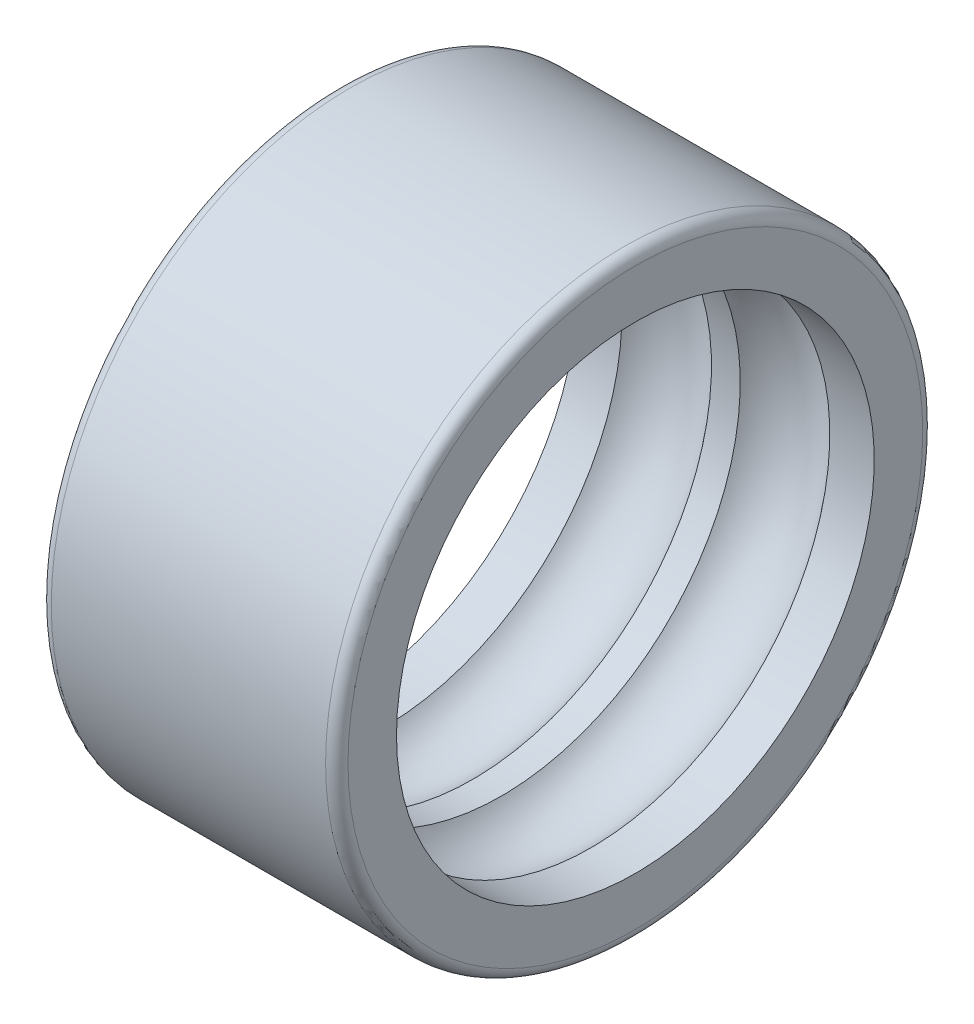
ISO-10303-21;
HEADER;
FILE_DESCRIPTION(('STEP AP214'),'2;1');
FILE_NAME('part.step','',(''),(''),'','','');
FILE_SCHEMA(('AUTOMOTIVE_DESIGN { 1 0 10303 214 1 1 1 1 }'));
ENDSEC;
DATA;
#1=APPLICATION_CONTEXT('core data for automotive mechanical design processes');
#2=APPLICATION_PROTOCOL_DEFINITION('international standard','automotive_design',2000,#1);
#3=PRODUCT_CONTEXT('',#1,'mechanical');
#4=PRODUCT('Part','Part','',(#3));
#5=PRODUCT_RELATED_PRODUCT_CATEGORY('part','',(#4));
#6=PRODUCT_DEFINITION_FORMATION('','',#4);
#7=PRODUCT_DEFINITION_CONTEXT('part definition',#1,'design');
#8=PRODUCT_DEFINITION('design','',#6,#7);
#9=PRODUCT_DEFINITION_SHAPE('','',#8);
#10=(LENGTH_UNIT() NAMED_UNIT(*) SI_UNIT(.MILLI.,.METRE.));
#11=(NAMED_UNIT(*) PLANE_ANGLE_UNIT() SI_UNIT($,.RADIAN.));
#12=(NAMED_UNIT(*) SI_UNIT($,.STERADIAN.) SOLID_ANGLE_UNIT());
#13=UNCERTAINTY_MEASURE_WITH_UNIT(LENGTH_MEASURE(1.E-05),#10,'distance_accuracy_value','');
#14=(GEOMETRIC_REPRESENTATION_CONTEXT(3) GLOBAL_UNCERTAINTY_ASSIGNED_CONTEXT((#13)) GLOBAL_UNIT_ASSIGNED_CONTEXT((#10,
#11,#12)) REPRESENTATION_CONTEXT('',''));
#15=CARTESIAN_POINT('',(0.,0.,0.));
#16=DIRECTION('',(0.,0.,1.));
#17=DIRECTION('',(1.,0.,0.));
#18=AXIS2_PLACEMENT_3D('',#15,#16,#17);
#19=CARTESIAN_POINT('',(15.3,0.,0.));
#20=DIRECTION('',(-1.,0.,0.));
#21=DIRECTION('',(0.,0.,1.));
#22=AXIS2_PLACEMENT_3D('',#19,#20,#21);
#23=TOROIDAL_SURFACE('',#22,15.4,0.6);
#24=CARTESIAN_POINT('',(15.3,0.,0.));
#25=DIRECTION('',(-1.,0.,0.));
#26=DIRECTION('',(0.,0.,1.));
#27=AXIS2_PLACEMENT_3D('',#24,#25,#26);
#28=CIRCLE('',#27,16.);
#29=CARTESIAN_POINT('',(15.3,0.,16.));
#30=VERTEX_POINT('',#29);
#31=EDGE_CURVE('E10',#30,#30,#28,.T.);
#32=ORIENTED_EDGE('',*,*,#31,.F.);
#33=EDGE_LOOP('',(#32));
#34=FACE_BOUND('',#33,.T.);
#35=CARTESIAN_POINT('',(15.9,0.,0.));
#36=DIRECTION('',(-1.,0.,0.));
#37=DIRECTION('',(0.,0.,1.));
#38=AXIS2_PLACEMENT_3D('',#35,#36,#37);
#39=CIRCLE('',#38,15.4);
#40=CARTESIAN_POINT('',(15.9,0.,15.4));
#41=VERTEX_POINT('',#40);
#42=EDGE_CURVE('E49',#41,#41,#39,.T.);
#43=ORIENTED_EDGE('',*,*,#42,.T.);
#44=EDGE_LOOP('',(#43));
#45=FACE_BOUND('',#44,.T.);
#46=ADVANCED_FACE('F14',(#34,#45),#23,.T.);
#47=CARTESIAN_POINT('',(0.,0.,0.));
#48=DIRECTION('',(-1.,0.,0.));
#49=DIRECTION('',(0.,0.,1.));
#50=AXIS2_PLACEMENT_3D('',#47,#48,#49);
#51=CYLINDRICAL_SURFACE('',#50,16.);
#52=CARTESIAN_POINT('',(0.6,0.,0.));
#53=DIRECTION('',(-1.,0.,0.));
#54=DIRECTION('',(0.,0.,1.));
#55=AXIS2_PLACEMENT_3D('',#52,#53,#54);
#56=CIRCLE('',#55,16.);
#57=CARTESIAN_POINT('',(0.6,0.,16.));
#58=VERTEX_POINT('',#57);
#59=EDGE_CURVE('E20',#58,#58,#56,.T.);
#60=ORIENTED_EDGE('',*,*,#59,.F.);
#61=EDGE_LOOP('',(#60));
#62=FACE_BOUND('',#61,.T.);
#63=ORIENTED_EDGE('',*,*,#31,.T.);
#64=EDGE_LOOP('',(#63));
#65=FACE_BOUND('',#64,.T.);
#66=ADVANCED_FACE('F80',(#62,#65),#51,.T.);
#67=CARTESIAN_POINT('',(0.6,0.,0.));
#68=DIRECTION('',(-1.,0.,0.));
#69=DIRECTION('',(0.,0.,1.));
#70=AXIS2_PLACEMENT_3D('',#67,#68,#69);
#71=TOROIDAL_SURFACE('',#70,15.4,0.6);
#72=CARTESIAN_POINT('',(0.,0.,0.));
#73=DIRECTION('',(-1.,0.,0.));
#74=DIRECTION('',(0.,0.,1.));
#75=AXIS2_PLACEMENT_3D('',#72,#73,#74);
#76=CIRCLE('',#75,15.4);
#77=CARTESIAN_POINT('',(0.,0.,15.4));
#78=VERTEX_POINT('',#77);
#79=EDGE_CURVE('E24',#78,#78,#76,.T.);
#80=ORIENTED_EDGE('',*,*,#79,.F.);
#81=EDGE_LOOP('',(#80));
#82=FACE_BOUND('',#81,.T.);
#83=ORIENTED_EDGE('',*,*,#59,.T.);
#84=EDGE_LOOP('',(#83));
#85=FACE_BOUND('',#84,.T.);
#86=ADVANCED_FACE('F87',(#82,#85),#71,.T.);
#87=CARTESIAN_POINT('',(0.,15.4,0.));
#88=DIRECTION('',(1.,0.,0.));
#89=DIRECTION('',(0.,0.,-1.));
#90=AXIS2_PLACEMENT_3D('',#87,#88,#89);
#91=PLANE('',#90);
#92=CARTESIAN_POINT('',(0.,0.,0.));
#93=DIRECTION('',(-1.,0.,0.));
#94=DIRECTION('',(0.,0.,1.));
#95=AXIS2_PLACEMENT_3D('',#92,#93,#94);
#96=CIRCLE('',#95,12.8);
#97=CARTESIAN_POINT('',(0.,0.,12.8));
#98=VERTEX_POINT('',#97);
#99=EDGE_CURVE('E28',#98,#98,#96,.T.);
#100=ORIENTED_EDGE('',*,*,#99,.F.);
#101=EDGE_LOOP('',(#100));
#102=FACE_BOUND('',#101,.T.);
#103=ORIENTED_EDGE('',*,*,#79,.T.);
#104=EDGE_LOOP('',(#103));
#105=FACE_BOUND('',#104,.T.);
#106=ADVANCED_FACE('F92',(#102,#105),#91,.F.);
#107=CARTESIAN_POINT('',(0.,0.,0.));
#108=DIRECTION('',(-1.,0.,0.));
#109=DIRECTION('',(0.,0.,1.));
#110=AXIS2_PLACEMENT_3D('',#107,#108,#109);
#111=CYLINDRICAL_SURFACE('',#110,12.8);
#112=CARTESIAN_POINT('',(2.37938423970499,0.,0.));
#113=DIRECTION('',(-1.,0.,0.));
#114=DIRECTION('',(0.,0.,1.));
#115=AXIS2_PLACEMENT_3D('',#112,#113,#114);
#116=CIRCLE('',#115,12.8);
#117=CARTESIAN_POINT('',(2.37938423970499,0.,12.8));
#118=VERTEX_POINT('',#117);
#119=EDGE_CURVE('E33',#118,#118,#116,.T.);
#120=ORIENTED_EDGE('',*,*,#119,.F.);
#121=EDGE_LOOP('',(#120));
#122=FACE_BOUND('',#121,.T.);
#123=ORIENTED_EDGE('',*,*,#99,.T.);
#124=EDGE_LOOP('',(#123));
#125=FACE_BOUND('',#124,.T.);
#126=ADVANCED_FACE('F98',(#122,#125),#111,.F.);
#127=CARTESIAN_POINT('',(4.77938423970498,0.,0.));
#128=DIRECTION('',(-1.,0.,0.));
#129=DIRECTION('',(0.,0.,1.));
#130=AXIS2_PLACEMENT_3D('',#127,#128,#129);
#131=TOROIDAL_SURFACE('',#130,11.,3.);
#132=ORIENTED_EDGE('',*,*,#119,.T.);
#133=EDGE_LOOP('',(#132));
#134=FACE_BOUND('',#133,.T.);
#135=CARTESIAN_POINT('',(7.17938423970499,0.,0.));
#136=DIRECTION('',(-1.,0.,0.));
#137=DIRECTION('',(0.,0.,1.));
#138=AXIS2_PLACEMENT_3D('',#135,#136,#137);
#139=CIRCLE('',#138,12.8);
#140=CARTESIAN_POINT('',(7.17938423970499,0.,12.8));
#141=VERTEX_POINT('',#140);
#142=EDGE_CURVE('E36',#141,#141,#139,.T.);
#143=ORIENTED_EDGE('',*,*,#142,.F.);
#144=EDGE_LOOP('',(#143));
#145=FACE_BOUND('',#144,.T.);
#146=ADVANCED_FACE('F76',(#134,#145),#131,.F.);
#147=CARTESIAN_POINT('',(0.,0.,0.));
#148=DIRECTION('',(-1.,0.,0.));
#149=DIRECTION('',(0.,0.,1.));
#150=AXIS2_PLACEMENT_3D('',#147,#148,#149);
#151=CYLINDRICAL_SURFACE('',#150,12.8);
#152=CARTESIAN_POINT('',(8.72061576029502,0.,0.));
#153=DIRECTION('',(-1.,0.,0.));
#154=DIRECTION('',(0.,0.,1.));
#155=AXIS2_PLACEMENT_3D('',#152,#153,#154);
#156=CIRCLE('',#155,12.8);
#157=CARTESIAN_POINT('',(8.72061576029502,0.,12.8));
#158=VERTEX_POINT('',#157);
#159=EDGE_CURVE('E39',#158,#158,#156,.T.);
#160=ORIENTED_EDGE('',*,*,#159,.F.);
#161=EDGE_LOOP('',(#160));
#162=FACE_BOUND('',#161,.T.);
#163=ORIENTED_EDGE('',*,*,#142,.T.);
#164=EDGE_LOOP('',(#163));
#165=FACE_BOUND('',#164,.T.);
#166=ADVANCED_FACE('F68',(#162,#165),#151,.F.);
#167=CARTESIAN_POINT('',(11.120615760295,0.,0.));
#168=DIRECTION('',(-1.,0.,0.));
#169=DIRECTION('',(0.,0.,1.));
#170=AXIS2_PLACEMENT_3D('',#167,#168,#169);
#171=TOROIDAL_SURFACE('',#170,11.,3.);
#172=ORIENTED_EDGE('',*,*,#159,.T.);
#173=EDGE_LOOP('',(#172));
#174=FACE_BOUND('',#173,.T.);
#175=CARTESIAN_POINT('',(13.520615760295,0.,0.));
#176=DIRECTION('',(-1.,0.,0.));
#177=DIRECTION('',(0.,0.,1.));
#178=AXIS2_PLACEMENT_3D('',#175,#176,#177);
#179=CIRCLE('',#178,12.8);
#180=CARTESIAN_POINT('',(13.520615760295,0.,12.8));
#181=VERTEX_POINT('',#180);
#182=EDGE_CURVE('E42',#181,#181,#179,.T.);
#183=ORIENTED_EDGE('',*,*,#182,.F.);
#184=EDGE_LOOP('',(#183));
#185=FACE_BOUND('',#184,.T.);
#186=ADVANCED_FACE('F63',(#174,#185),#171,.F.);
#187=CARTESIAN_POINT('',(0.,0.,0.));
#188=DIRECTION('',(-1.,0.,0.));
#189=DIRECTION('',(0.,0.,1.));
#190=AXIS2_PLACEMENT_3D('',#187,#188,#189);
#191=CYLINDRICAL_SURFACE('',#190,12.8);
#192=CARTESIAN_POINT('',(15.9,0.,0.));
#193=DIRECTION('',(-1.,0.,0.));
#194=DIRECTION('',(0.,0.,1.));
#195=AXIS2_PLACEMENT_3D('',#192,#193,#194);
#196=CIRCLE('',#195,12.8);
#197=CARTESIAN_POINT('',(15.9,0.,12.8));
#198=VERTEX_POINT('',#197);
#199=EDGE_CURVE('E45',#198,#198,#196,.T.);
#200=ORIENTED_EDGE('',*,*,#199,.F.);
#201=EDGE_LOOP('',(#200));
#202=FACE_BOUND('',#201,.T.);
#203=ORIENTED_EDGE('',*,*,#182,.T.);
#204=EDGE_LOOP('',(#203));
#205=FACE_BOUND('',#204,.T.);
#206=ADVANCED_FACE('F57',(#202,#205),#191,.F.);
#207=CARTESIAN_POINT('',(15.9,12.8,0.));
#208=DIRECTION('',(-1.,0.,0.));
#209=DIRECTION('',(0.,0.,1.));
#210=AXIS2_PLACEMENT_3D('',#207,#208,#209);
#211=PLANE('',#210);
#212=ORIENTED_EDGE('',*,*,#42,.F.);
#213=EDGE_LOOP('',(#212));
#214=FACE_BOUND('',#213,.T.);
#215=ORIENTED_EDGE('',*,*,#199,.T.);
#216=EDGE_LOOP('',(#215));
#217=FACE_BOUND('',#216,.T.);
#218=ADVANCED_FACE('F54',(#214,#217),#211,.F.);
#219=CLOSED_SHELL('',(#46,#66,#86,#106,#126,#146,#166,#186,#206,#218));
#220=MANIFOLD_SOLID_BREP('B1',#219);
#221=ADVANCED_BREP_SHAPE_REPRESENTATION('',(#18,#220),#14);
#222=SHAPE_DEFINITION_REPRESENTATION(#9,#221);
ENDSEC;
END-ISO-10303-21;
